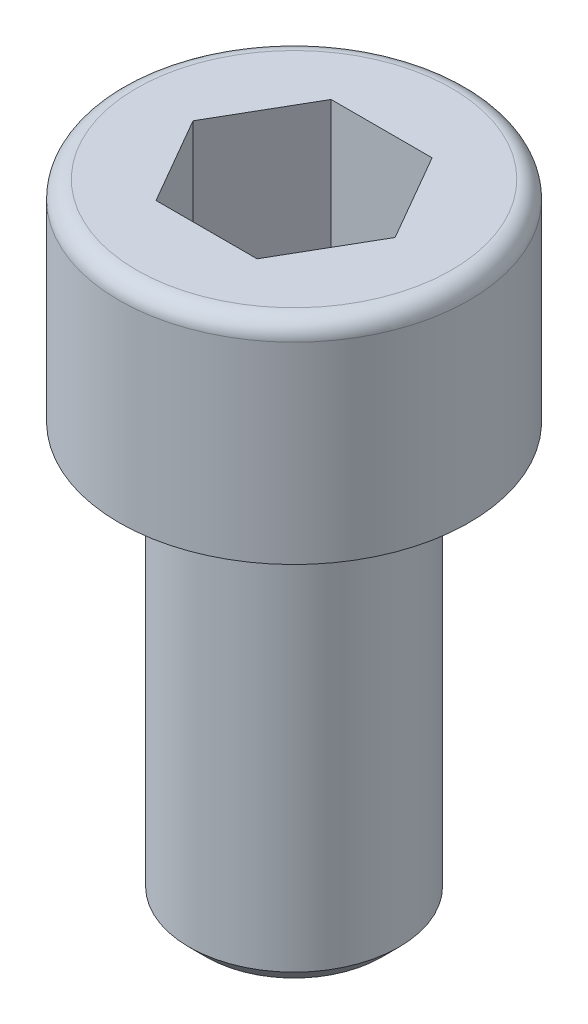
from build123d import *

# Parameters (mm, degrees)
ENL_V_MAT_EXTRU_1_DEPTH = 4
CHANFREIN1_SIZE         = 0.5


with BuildPart() as part:
    # Esquisse1 → Base-R_volution (revolve)
    with BuildSketch(Plane.XY, mode=Mode.PRIVATE) as base_r_volution_sk:
        with BuildLine():
            Line((0, 18), (-4.5, 18))
            ThreePointArc((-4.5, 18), (-4.853553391, 17.853553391), (-5, 17.5))
            Line((-5, 17.5), (-5, 12))
            Line((-5, 12), (-3, 12))
            Line((-3, 12), (-3, 0))
            Line((-3, 0), (0, 0))
            Line((0, 0), (0, 18))
        make_face()
    revolve(base_r_volution_sk.sketch.rotate(Axis((0, 50, 0), (0, -1, 0)), 270), axis=Axis((0, 50, 0), (0, -1, 0)))

    # Esquisse2 → Enl_v. mat.-Extru.1 (cut)
    with BuildSketch(Plane(origin=(0, 18, 0), x_dir=(-1, 0, 0), z_dir=(0, 1, 0))):
        Polygon((1.443375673, -2.5), (-1.443375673, -2.5), (-2.886751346, 0), (-1.443375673, 2.5), (1.443375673, 2.5), (2.886751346, 0), align=None)
    extrude(amount=-ENL_V_MAT_EXTRU_1_DEPTH, mode=Mode.SUBTRACT)

    # Chanfrein1
    chanfrein1_edges = [part.edges().sort_by_distance(p)[0] for p in [
        (0, 0, -3),
    ]]
    chamfer(chanfrein1_edges, length=CHANFREIN1_SIZE)


solid = part.part
